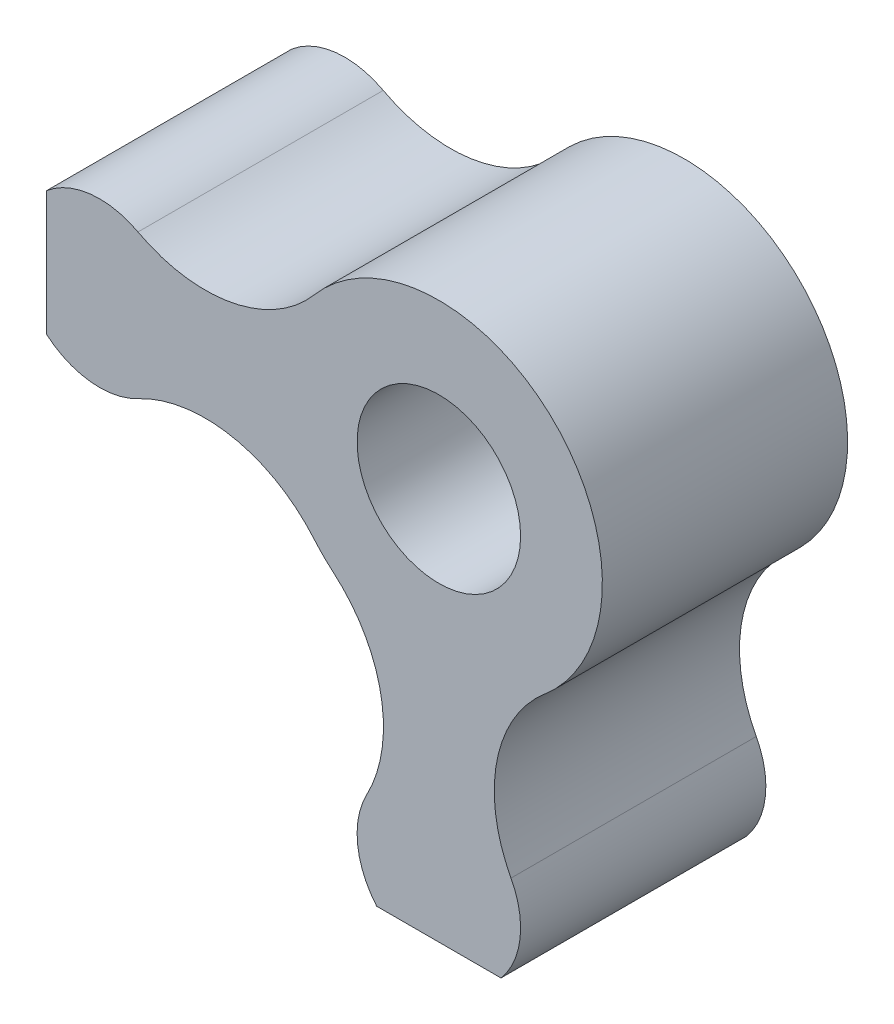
ISO-10303-21;
HEADER;
FILE_DESCRIPTION(('STEP AP214'),'2;1');
FILE_NAME('part.step','',(''),(''),'','','');
FILE_SCHEMA(('AUTOMOTIVE_DESIGN { 1 0 10303 214 1 1 1 1 }'));
ENDSEC;
DATA;
#1=APPLICATION_CONTEXT('core data for automotive mechanical design processes');
#2=APPLICATION_PROTOCOL_DEFINITION('international standard','automotive_design',2000,#1);
#3=PRODUCT_CONTEXT('',#1,'mechanical');
#4=PRODUCT('Part','Part','',(#3));
#5=PRODUCT_RELATED_PRODUCT_CATEGORY('part','',(#4));
#6=PRODUCT_DEFINITION_FORMATION('','',#4);
#7=PRODUCT_DEFINITION_CONTEXT('part definition',#1,'design');
#8=PRODUCT_DEFINITION('design','',#6,#7);
#9=PRODUCT_DEFINITION_SHAPE('','',#8);
#10=(LENGTH_UNIT() NAMED_UNIT(*) SI_UNIT(.MILLI.,.METRE.));
#11=(NAMED_UNIT(*) PLANE_ANGLE_UNIT() SI_UNIT($,.RADIAN.));
#12=(NAMED_UNIT(*) SI_UNIT($,.STERADIAN.) SOLID_ANGLE_UNIT());
#13=UNCERTAINTY_MEASURE_WITH_UNIT(LENGTH_MEASURE(1.E-05),#10,'distance_accuracy_value','');
#14=(GEOMETRIC_REPRESENTATION_CONTEXT(3) GLOBAL_UNCERTAINTY_ASSIGNED_CONTEXT((#13)) GLOBAL_UNIT_ASSIGNED_CONTEXT((#10,
#11,#12)) REPRESENTATION_CONTEXT('',''));
#15=CARTESIAN_POINT('',(0.,0.,0.));
#16=DIRECTION('',(0.,0.,1.));
#17=DIRECTION('',(1.,0.,0.));
#18=AXIS2_PLACEMENT_3D('',#15,#16,#17);
#19=CARTESIAN_POINT('',(0.,0.,3.));
#20=DIRECTION('',(0.,0.,1.));
#21=DIRECTION('',(1.,0.,0.));
#22=AXIS2_PLACEMENT_3D('',#19,#20,#21);
#23=PLANE('',#22);
#24=CARTESIAN_POINT('',(0.,0.,3.));
#25=DIRECTION('',(0.,0.,1.));
#26=DIRECTION('',(1.,0.,0.));
#27=AXIS2_PLACEMENT_3D('',#24,#25,#26);
#28=CIRCLE('',#27,4.);
#29=CARTESIAN_POINT('',(2.58951396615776,-3.04867469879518,3.));
#30=VERTEX_POINT('',#29);
#31=CARTESIAN_POINT('',(-3.04867469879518,2.58951396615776,3.));
#32=VERTEX_POINT('',#31);
#33=EDGE_CURVE('E482',#30,#32,#28,.T.);
#34=ORIENTED_EDGE('',*,*,#33,.T.);
#35=CARTESIAN_POINT('',(-5.71626506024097,4.85533868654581,3.));
#36=DIRECTION('',(0.,0.,-1.));
#37=DIRECTION('',(1.,0.,0.));
#38=AXIS2_PLACEMENT_3D('',#35,#36,#37);
#39=CIRCLE('',#38,3.5);
#40=CARTESIAN_POINT('',(-7.36046002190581,1.76557770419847,3.));
#41=VERTEX_POINT('',#40);
#42=EDGE_CURVE('E451',#32,#41,#39,.T.);
#43=ORIENTED_EDGE('',*,*,#42,.T.);
#44=CARTESIAN_POINT('',(-8.3,0.,3.));
#45=DIRECTION('',(0.,0.,1.));
#46=DIRECTION('',(1.,0.,0.));
#47=AXIS2_PLACEMENT_3D('',#44,#45,#46);
#48=CIRCLE('',#47,2.);
#49=CARTESIAN_POINT('',(-9.6,1.51986841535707,3.));
#50=VERTEX_POINT('',#49);
#51=EDGE_CURVE('E485',#41,#50,#48,.T.);
#52=ORIENTED_EDGE('',*,*,#51,.T.);
#53=DIRECTION('',(0.,-1.,0.));
#54=VECTOR('',#53,1.);
#55=CARTESIAN_POINT('',(-9.6,1.51986841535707,3.));
#56=LINE('',#55,#54);
#57=CARTESIAN_POINT('',(-9.6,-1.51986841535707,3.));
#58=VERTEX_POINT('',#57);
#59=EDGE_CURVE('E487',#50,#58,#56,.T.);
#60=ORIENTED_EDGE('',*,*,#59,.T.);
#61=CARTESIAN_POINT('',(-8.3,0.,3.));
#62=DIRECTION('',(0.,0.,1.));
#63=DIRECTION('',(1.,0.,0.));
#64=AXIS2_PLACEMENT_3D('',#61,#62,#63);
#65=CIRCLE('',#64,2.);
#66=CARTESIAN_POINT('',(-7.3604600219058,-1.76557770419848,3.));
#67=VERTEX_POINT('',#66);
#68=EDGE_CURVE('E489',#58,#67,#65,.T.);
#69=ORIENTED_EDGE('',*,*,#68,.T.);
#70=CARTESIAN_POINT('',(-5.71626506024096,-4.85533868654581,3.));
#71=DIRECTION('',(0.,0.,-1.));
#72=DIRECTION('',(1.,0.,0.));
#73=AXIS2_PLACEMENT_3D('',#70,#71,#72);
#74=CIRCLE('',#73,3.5);
#75=CARTESIAN_POINT('',(-3.04867469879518,-2.58951396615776,3.));
#76=VERTEX_POINT('',#75);
#77=EDGE_CURVE('E491',#67,#76,#74,.T.);
#78=ORIENTED_EDGE('',*,*,#77,.T.);
#79=CARTESIAN_POINT('',(0.,0.,3.));
#80=DIRECTION('',(0.,0.,1.));
#81=DIRECTION('',(1.,0.,0.));
#82=AXIS2_PLACEMENT_3D('',#79,#80,#81);
#83=CIRCLE('',#82,4.);
#84=CARTESIAN_POINT('',(-2.58951396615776,-3.04867469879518,3.));
#85=VERTEX_POINT('',#84);
#86=EDGE_CURVE('E493',#76,#85,#83,.T.);
#87=ORIENTED_EDGE('',*,*,#86,.T.);
#88=CARTESIAN_POINT('',(-4.85533868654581,-5.71626506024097,3.));
#89=DIRECTION('',(0.,0.,-1.));
#90=DIRECTION('',(1.,0.,0.));
#91=AXIS2_PLACEMENT_3D('',#88,#89,#90);
#92=CIRCLE('',#91,3.5);
#93=CARTESIAN_POINT('',(-1.76557770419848,-7.36046002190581,3.));
#94=VERTEX_POINT('',#93);
#95=EDGE_CURVE('E495',#85,#94,#92,.T.);
#96=ORIENTED_EDGE('',*,*,#95,.T.);
#97=CARTESIAN_POINT('',(0.,-8.3,3.));
#98=DIRECTION('',(0.,0.,1.));
#99=DIRECTION('',(1.,0.,0.));
#100=AXIS2_PLACEMENT_3D('',#97,#98,#99);
#101=CIRCLE('',#100,2.);
#102=CARTESIAN_POINT('',(-1.51986841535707,-9.6,3.));
#103=VERTEX_POINT('',#102);
#104=EDGE_CURVE('E497',#94,#103,#101,.T.);
#105=ORIENTED_EDGE('',*,*,#104,.T.);
#106=DIRECTION('',(1.,0.,0.));
#107=VECTOR('',#106,1.);
#108=CARTESIAN_POINT('',(-1.51986841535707,-9.6,3.));
#109=LINE('',#108,#107);
#110=CARTESIAN_POINT('',(1.51986841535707,-9.6,3.));
#111=VERTEX_POINT('',#110);
#112=EDGE_CURVE('E499',#103,#111,#109,.T.);
#113=ORIENTED_EDGE('',*,*,#112,.T.);
#114=CARTESIAN_POINT('',(0.,-8.3,3.));
#115=DIRECTION('',(0.,0.,1.));
#116=DIRECTION('',(1.,0.,0.));
#117=AXIS2_PLACEMENT_3D('',#114,#115,#116);
#118=CIRCLE('',#117,2.);
#119=CARTESIAN_POINT('',(1.76557770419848,-7.3604600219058,3.));
#120=VERTEX_POINT('',#119);
#121=EDGE_CURVE('E368',#111,#120,#118,.T.);
#122=ORIENTED_EDGE('',*,*,#121,.T.);
#123=CARTESIAN_POINT('',(4.85533868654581,-5.71626506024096,3.));
#124=DIRECTION('',(0.,0.,-1.));
#125=DIRECTION('',(1.,0.,0.));
#126=AXIS2_PLACEMENT_3D('',#123,#124,#125);
#127=CIRCLE('',#126,3.5);
#128=EDGE_CURVE('E363',#120,#30,#127,.T.);
#129=ORIENTED_EDGE('',*,*,#128,.T.);
#130=EDGE_LOOP('',(#34,#43,#52,#60,#69,#78,#87,#96,#105,#113,#122,#129));
#131=FACE_BOUND('',#130,.T.);
#132=CARTESIAN_POINT('',(0.,0.,3.));
#133=DIRECTION('',(0.,0.,1.));
#134=DIRECTION('',(1.,0.,0.));
#135=AXIS2_PLACEMENT_3D('',#132,#133,#134);
#136=CIRCLE('',#135,2.);
#137=CARTESIAN_POINT('',(2.,0.,3.));
#138=VERTEX_POINT('',#137);
#139=EDGE_CURVE('E456',#138,#138,#136,.T.);
#140=ORIENTED_EDGE('',*,*,#139,.F.);
#141=EDGE_LOOP('',(#140));
#142=FACE_BOUND('',#141,.T.);
#143=ADVANCED_FACE('F348',(#131,#142),#23,.T.);
#144=CARTESIAN_POINT('',(0.,0.,-3.));
#145=DIRECTION('',(0.,0.,1.));
#146=DIRECTION('',(1.,0.,0.));
#147=AXIS2_PLACEMENT_3D('',#144,#145,#146);
#148=PLANE('',#147);
#149=CARTESIAN_POINT('',(0.,0.,-3.));
#150=DIRECTION('',(0.,0.,1.));
#151=DIRECTION('',(1.,0.,0.));
#152=AXIS2_PLACEMENT_3D('',#149,#150,#151);
#153=CIRCLE('',#152,4.);
#154=CARTESIAN_POINT('',(2.58951396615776,-3.04867469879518,-3.));
#155=VERTEX_POINT('',#154);
#156=CARTESIAN_POINT('',(-3.04867469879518,2.58951396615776,-3.));
#157=VERTEX_POINT('',#156);
#158=EDGE_CURVE('E442',#155,#157,#153,.T.);
#159=ORIENTED_EDGE('',*,*,#158,.F.);
#160=CARTESIAN_POINT('',(4.85533868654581,-5.71626506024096,-3.));
#161=DIRECTION('',(0.,0.,-1.));
#162=DIRECTION('',(1.,0.,0.));
#163=AXIS2_PLACEMENT_3D('',#160,#161,#162);
#164=CIRCLE('',#163,3.5);
#165=CARTESIAN_POINT('',(1.76557770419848,-7.3604600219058,-3.));
#166=VERTEX_POINT('',#165);
#167=EDGE_CURVE('E480',#166,#155,#164,.T.);
#168=ORIENTED_EDGE('',*,*,#167,.F.);
#169=CARTESIAN_POINT('',(0.,-8.3,-3.));
#170=DIRECTION('',(0.,0.,1.));
#171=DIRECTION('',(1.,0.,0.));
#172=AXIS2_PLACEMENT_3D('',#169,#170,#171);
#173=CIRCLE('',#172,2.);
#174=CARTESIAN_POINT('',(1.51986841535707,-9.6,-3.));
#175=VERTEX_POINT('',#174);
#176=EDGE_CURVE('E478',#175,#166,#173,.T.);
#177=ORIENTED_EDGE('',*,*,#176,.F.);
#178=DIRECTION('',(1.,0.,0.));
#179=VECTOR('',#178,1.);
#180=CARTESIAN_POINT('',(-1.51986841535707,-9.6,-3.));
#181=LINE('',#180,#179);
#182=CARTESIAN_POINT('',(-1.51986841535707,-9.6,-3.));
#183=VERTEX_POINT('',#182);
#184=EDGE_CURVE('E476',#183,#175,#181,.T.);
#185=ORIENTED_EDGE('',*,*,#184,.F.);
#186=CARTESIAN_POINT('',(0.,-8.3,-3.));
#187=DIRECTION('',(0.,0.,1.));
#188=DIRECTION('',(1.,0.,0.));
#189=AXIS2_PLACEMENT_3D('',#186,#187,#188);
#190=CIRCLE('',#189,2.);
#191=CARTESIAN_POINT('',(-1.76557770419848,-7.36046002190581,-3.));
#192=VERTEX_POINT('',#191);
#193=EDGE_CURVE('E474',#192,#183,#190,.T.);
#194=ORIENTED_EDGE('',*,*,#193,.F.);
#195=CARTESIAN_POINT('',(-4.85533868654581,-5.71626506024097,-3.));
#196=DIRECTION('',(0.,0.,-1.));
#197=DIRECTION('',(1.,0.,0.));
#198=AXIS2_PLACEMENT_3D('',#195,#196,#197);
#199=CIRCLE('',#198,3.5);
#200=CARTESIAN_POINT('',(-2.58951396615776,-3.04867469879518,-3.));
#201=VERTEX_POINT('',#200);
#202=EDGE_CURVE('E472',#201,#192,#199,.T.);
#203=ORIENTED_EDGE('',*,*,#202,.F.);
#204=CARTESIAN_POINT('',(0.,0.,-3.));
#205=DIRECTION('',(0.,0.,1.));
#206=DIRECTION('',(1.,0.,0.));
#207=AXIS2_PLACEMENT_3D('',#204,#205,#206);
#208=CIRCLE('',#207,4.);
#209=CARTESIAN_POINT('',(-3.04867469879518,-2.58951396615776,-3.));
#210=VERTEX_POINT('',#209);
#211=EDGE_CURVE('E470',#210,#201,#208,.T.);
#212=ORIENTED_EDGE('',*,*,#211,.F.);
#213=CARTESIAN_POINT('',(-5.71626506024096,-4.85533868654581,-3.));
#214=DIRECTION('',(0.,0.,-1.));
#215=DIRECTION('',(1.,0.,0.));
#216=AXIS2_PLACEMENT_3D('',#213,#214,#215);
#217=CIRCLE('',#216,3.5);
#218=CARTESIAN_POINT('',(-7.3604600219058,-1.76557770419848,-3.));
#219=VERTEX_POINT('',#218);
#220=EDGE_CURVE('E468',#219,#210,#217,.T.);
#221=ORIENTED_EDGE('',*,*,#220,.F.);
#222=CARTESIAN_POINT('',(-8.3,0.,-3.));
#223=DIRECTION('',(0.,0.,1.));
#224=DIRECTION('',(1.,0.,0.));
#225=AXIS2_PLACEMENT_3D('',#222,#223,#224);
#226=CIRCLE('',#225,2.);
#227=CARTESIAN_POINT('',(-9.6,-1.51986841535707,-3.));
#228=VERTEX_POINT('',#227);
#229=EDGE_CURVE('E466',#228,#219,#226,.T.);
#230=ORIENTED_EDGE('',*,*,#229,.F.);
#231=DIRECTION('',(0.,-1.,0.));
#232=VECTOR('',#231,1.);
#233=CARTESIAN_POINT('',(-9.6,1.51986841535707,-3.));
#234=LINE('',#233,#232);
#235=CARTESIAN_POINT('',(-9.6,1.51986841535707,-3.));
#236=VERTEX_POINT('',#235);
#237=EDGE_CURVE('E464',#236,#228,#234,.T.);
#238=ORIENTED_EDGE('',*,*,#237,.F.);
#239=CARTESIAN_POINT('',(-8.3,0.,-3.));
#240=DIRECTION('',(0.,0.,1.));
#241=DIRECTION('',(1.,0.,0.));
#242=AXIS2_PLACEMENT_3D('',#239,#240,#241);
#243=CIRCLE('',#242,2.);
#244=CARTESIAN_POINT('',(-7.36046002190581,1.76557770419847,-3.));
#245=VERTEX_POINT('',#244);
#246=EDGE_CURVE('E444',#245,#236,#243,.T.);
#247=ORIENTED_EDGE('',*,*,#246,.F.);
#248=CARTESIAN_POINT('',(-5.71626506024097,4.85533868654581,-3.));
#249=DIRECTION('',(0.,0.,-1.));
#250=DIRECTION('',(1.,0.,0.));
#251=AXIS2_PLACEMENT_3D('',#248,#249,#250);
#252=CIRCLE('',#251,3.5);
#253=EDGE_CURVE('E437',#157,#245,#252,.T.);
#254=ORIENTED_EDGE('',*,*,#253,.F.);
#255=EDGE_LOOP('',(#159,#168,#177,#185,#194,#203,#212,#221,#230,#238,#247,#254));
#256=FACE_BOUND('',#255,.T.);
#257=CARTESIAN_POINT('',(0.,0.,-3.));
#258=DIRECTION('',(0.,0.,1.));
#259=DIRECTION('',(1.,0.,0.));
#260=AXIS2_PLACEMENT_3D('',#257,#258,#259);
#261=CIRCLE('',#260,2.);
#262=CARTESIAN_POINT('',(2.,0.,-3.));
#263=VERTEX_POINT('',#262);
#264=EDGE_CURVE('E459',#263,#263,#261,.T.);
#265=ORIENTED_EDGE('',*,*,#264,.T.);
#266=EDGE_LOOP('',(#265));
#267=FACE_BOUND('',#266,.T.);
#268=ADVANCED_FACE('F438',(#256,#267),#148,.F.);
#269=CARTESIAN_POINT('',(0.,0.,3.));
#270=DIRECTION('',(0.,0.,-1.));
#271=DIRECTION('',(-1.,0.,0.));
#272=AXIS2_PLACEMENT_3D('',#269,#270,#271);
#273=CYLINDRICAL_SURFACE('',#272,4.);
#274=ORIENTED_EDGE('',*,*,#158,.T.);
#275=DIRECTION('',(0.,0.,-1.));
#276=VECTOR('',#275,1.);
#277=CARTESIAN_POINT('',(-3.04867469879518,2.58951396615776,3.));
#278=LINE('',#277,#276);
#279=EDGE_CURVE('E11',#32,#157,#278,.T.);
#280=ORIENTED_EDGE('',*,*,#279,.F.);
#281=ORIENTED_EDGE('',*,*,#33,.F.);
#282=DIRECTION('',(0.,0.,-1.));
#283=VECTOR('',#282,1.);
#284=CARTESIAN_POINT('',(2.58951396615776,-3.04867469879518,3.));
#285=LINE('',#284,#283);
#286=EDGE_CURVE('E455',#30,#155,#285,.T.);
#287=ORIENTED_EDGE('',*,*,#286,.T.);
#288=EDGE_LOOP('',(#274,#280,#281,#287));
#289=FACE_BOUND('',#288,.T.);
#290=ADVANCED_FACE('F350',(#289),#273,.T.);
#291=CARTESIAN_POINT('',(-5.71626506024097,4.85533868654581,3.));
#292=DIRECTION('',(0.,0.,-1.));
#293=DIRECTION('',(-1.,0.,0.));
#294=AXIS2_PLACEMENT_3D('',#291,#292,#293);
#295=CYLINDRICAL_SURFACE('',#294,3.5);
#296=ORIENTED_EDGE('',*,*,#253,.T.);
#297=DIRECTION('',(0.,0.,-1.));
#298=VECTOR('',#297,1.);
#299=CARTESIAN_POINT('',(-7.36046002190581,1.76557770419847,3.));
#300=LINE('',#299,#298);
#301=EDGE_CURVE('E356',#41,#245,#300,.T.);
#302=ORIENTED_EDGE('',*,*,#301,.F.);
#303=ORIENTED_EDGE('',*,*,#42,.F.);
#304=ORIENTED_EDGE('',*,*,#279,.T.);
#305=EDGE_LOOP('',(#296,#302,#303,#304));
#306=FACE_BOUND('',#305,.T.);
#307=ADVANCED_FACE('F450',(#306),#295,.F.);
#308=CARTESIAN_POINT('',(-8.3,0.,3.));
#309=DIRECTION('',(0.,0.,-1.));
#310=DIRECTION('',(-1.,0.,0.));
#311=AXIS2_PLACEMENT_3D('',#308,#309,#310);
#312=CYLINDRICAL_SURFACE('',#311,2.);
#313=ORIENTED_EDGE('',*,*,#246,.T.);
#314=DIRECTION('',(0.,0.,-1.));
#315=VECTOR('',#314,1.);
#316=CARTESIAN_POINT('',(-9.6,1.51986841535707,3.));
#317=LINE('',#316,#315);
#318=EDGE_CURVE('E528',#50,#236,#317,.T.);
#319=ORIENTED_EDGE('',*,*,#318,.F.);
#320=ORIENTED_EDGE('',*,*,#51,.F.);
#321=ORIENTED_EDGE('',*,*,#301,.T.);
#322=EDGE_LOOP('',(#313,#319,#320,#321));
#323=FACE_BOUND('',#322,.T.);
#324=ADVANCED_FACE('F532',(#323),#312,.T.);
#325=CARTESIAN_POINT('',(-9.6,1.51986841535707,3.));
#326=DIRECTION('',(1.,0.,0.));
#327=DIRECTION('',(0.,0.,-1.));
#328=AXIS2_PLACEMENT_3D('',#325,#326,#327);
#329=PLANE('',#328);
#330=ORIENTED_EDGE('',*,*,#237,.T.);
#331=DIRECTION('',(0.,0.,-1.));
#332=VECTOR('',#331,1.);
#333=CARTESIAN_POINT('',(-9.6,-1.51986841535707,3.));
#334=LINE('',#333,#332);
#335=EDGE_CURVE('E525',#58,#228,#334,.T.);
#336=ORIENTED_EDGE('',*,*,#335,.F.);
#337=ORIENTED_EDGE('',*,*,#59,.F.);
#338=ORIENTED_EDGE('',*,*,#318,.T.);
#339=EDGE_LOOP('',(#330,#336,#337,#338));
#340=FACE_BOUND('',#339,.T.);
#341=ADVANCED_FACE('F540',(#340),#329,.F.);
#342=CARTESIAN_POINT('',(-8.3,0.,3.));
#343=DIRECTION('',(0.,0.,-1.));
#344=DIRECTION('',(-1.,0.,0.));
#345=AXIS2_PLACEMENT_3D('',#342,#343,#344);
#346=CYLINDRICAL_SURFACE('',#345,2.);
#347=ORIENTED_EDGE('',*,*,#229,.T.);
#348=DIRECTION('',(0.,0.,-1.));
#349=VECTOR('',#348,1.);
#350=CARTESIAN_POINT('',(-7.3604600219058,-1.76557770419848,3.));
#351=LINE('',#350,#349);
#352=EDGE_CURVE('E522',#67,#219,#351,.T.);
#353=ORIENTED_EDGE('',*,*,#352,.F.);
#354=ORIENTED_EDGE('',*,*,#68,.F.);
#355=ORIENTED_EDGE('',*,*,#335,.T.);
#356=EDGE_LOOP('',(#347,#353,#354,#355));
#357=FACE_BOUND('',#356,.T.);
#358=ADVANCED_FACE('F543',(#357),#346,.T.);
#359=CARTESIAN_POINT('',(-5.71626506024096,-4.85533868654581,3.));
#360=DIRECTION('',(0.,0.,-1.));
#361=DIRECTION('',(-1.,0.,0.));
#362=AXIS2_PLACEMENT_3D('',#359,#360,#361);
#363=CYLINDRICAL_SURFACE('',#362,3.5);
#364=ORIENTED_EDGE('',*,*,#220,.T.);
#365=DIRECTION('',(0.,0.,-1.));
#366=VECTOR('',#365,1.);
#367=CARTESIAN_POINT('',(-3.04867469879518,-2.58951396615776,3.));
#368=LINE('',#367,#366);
#369=EDGE_CURVE('E519',#76,#210,#368,.T.);
#370=ORIENTED_EDGE('',*,*,#369,.F.);
#371=ORIENTED_EDGE('',*,*,#77,.F.);
#372=ORIENTED_EDGE('',*,*,#352,.T.);
#373=EDGE_LOOP('',(#364,#370,#371,#372));
#374=FACE_BOUND('',#373,.T.);
#375=ADVANCED_FACE('F548',(#374),#363,.F.);
#376=CARTESIAN_POINT('',(0.,0.,3.));
#377=DIRECTION('',(0.,0.,-1.));
#378=DIRECTION('',(-1.,0.,0.));
#379=AXIS2_PLACEMENT_3D('',#376,#377,#378);
#380=CYLINDRICAL_SURFACE('',#379,4.);
#381=ORIENTED_EDGE('',*,*,#211,.T.);
#382=DIRECTION('',(0.,0.,-1.));
#383=VECTOR('',#382,1.);
#384=CARTESIAN_POINT('',(-2.58951396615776,-3.04867469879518,3.));
#385=LINE('',#384,#383);
#386=EDGE_CURVE('E516',#85,#201,#385,.T.);
#387=ORIENTED_EDGE('',*,*,#386,.F.);
#388=ORIENTED_EDGE('',*,*,#86,.F.);
#389=ORIENTED_EDGE('',*,*,#369,.T.);
#390=EDGE_LOOP('',(#381,#387,#388,#389));
#391=FACE_BOUND('',#390,.T.);
#392=ADVANCED_FACE('F554',(#391),#380,.T.);
#393=CARTESIAN_POINT('',(-4.85533868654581,-5.71626506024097,3.));
#394=DIRECTION('',(0.,0.,-1.));
#395=DIRECTION('',(-1.,0.,0.));
#396=AXIS2_PLACEMENT_3D('',#393,#394,#395);
#397=CYLINDRICAL_SURFACE('',#396,3.5);
#398=ORIENTED_EDGE('',*,*,#202,.T.);
#399=DIRECTION('',(0.,0.,-1.));
#400=VECTOR('',#399,1.);
#401=CARTESIAN_POINT('',(-1.76557770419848,-7.36046002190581,3.));
#402=LINE('',#401,#400);
#403=EDGE_CURVE('E513',#94,#192,#402,.T.);
#404=ORIENTED_EDGE('',*,*,#403,.F.);
#405=ORIENTED_EDGE('',*,*,#95,.F.);
#406=ORIENTED_EDGE('',*,*,#386,.T.);
#407=EDGE_LOOP('',(#398,#404,#405,#406));
#408=FACE_BOUND('',#407,.T.);
#409=ADVANCED_FACE('F558',(#408),#397,.F.);
#410=CARTESIAN_POINT('',(0.,-8.3,3.));
#411=DIRECTION('',(0.,0.,-1.));
#412=DIRECTION('',(-1.,0.,0.));
#413=AXIS2_PLACEMENT_3D('',#410,#411,#412);
#414=CYLINDRICAL_SURFACE('',#413,2.);
#415=ORIENTED_EDGE('',*,*,#193,.T.);
#416=DIRECTION('',(0.,0.,-1.));
#417=VECTOR('',#416,1.);
#418=CARTESIAN_POINT('',(-1.51986841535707,-9.6,3.));
#419=LINE('',#418,#417);
#420=EDGE_CURVE('E510',#103,#183,#419,.T.);
#421=ORIENTED_EDGE('',*,*,#420,.F.);
#422=ORIENTED_EDGE('',*,*,#104,.F.);
#423=ORIENTED_EDGE('',*,*,#403,.T.);
#424=EDGE_LOOP('',(#415,#421,#422,#423));
#425=FACE_BOUND('',#424,.T.);
#426=ADVANCED_FACE('F563',(#425),#414,.T.);
#427=CARTESIAN_POINT('',(-1.51986841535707,-9.6,3.));
#428=DIRECTION('',(0.,1.,0.));
#429=DIRECTION('',(0.,0.,1.));
#430=AXIS2_PLACEMENT_3D('',#427,#428,#429);
#431=PLANE('',#430);
#432=ORIENTED_EDGE('',*,*,#184,.T.);
#433=DIRECTION('',(0.,0.,-1.));
#434=VECTOR('',#433,1.);
#435=CARTESIAN_POINT('',(1.51986841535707,-9.6,3.));
#436=LINE('',#435,#434);
#437=EDGE_CURVE('E507',#111,#175,#436,.T.);
#438=ORIENTED_EDGE('',*,*,#437,.F.);
#439=ORIENTED_EDGE('',*,*,#112,.F.);
#440=ORIENTED_EDGE('',*,*,#420,.T.);
#441=EDGE_LOOP('',(#432,#438,#439,#440));
#442=FACE_BOUND('',#441,.T.);
#443=ADVANCED_FACE('F567',(#442),#431,.F.);
#444=CARTESIAN_POINT('',(0.,-8.3,3.));
#445=DIRECTION('',(0.,0.,-1.));
#446=DIRECTION('',(-1.,0.,0.));
#447=AXIS2_PLACEMENT_3D('',#444,#445,#446);
#448=CYLINDRICAL_SURFACE('',#447,2.);
#449=ORIENTED_EDGE('',*,*,#176,.T.);
#450=DIRECTION('',(0.,0.,-1.));
#451=VECTOR('',#450,1.);
#452=CARTESIAN_POINT('',(1.76557770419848,-7.3604600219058,3.));
#453=LINE('',#452,#451);
#454=EDGE_CURVE('E504',#120,#166,#453,.T.);
#455=ORIENTED_EDGE('',*,*,#454,.F.);
#456=ORIENTED_EDGE('',*,*,#121,.F.);
#457=ORIENTED_EDGE('',*,*,#437,.T.);
#458=EDGE_LOOP('',(#449,#455,#456,#457));
#459=FACE_BOUND('',#458,.T.);
#460=ADVANCED_FACE('F571',(#459),#448,.T.);
#461=CARTESIAN_POINT('',(4.85533868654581,-5.71626506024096,3.));
#462=DIRECTION('',(0.,0.,-1.));
#463=DIRECTION('',(-1.,0.,0.));
#464=AXIS2_PLACEMENT_3D('',#461,#462,#463);
#465=CYLINDRICAL_SURFACE('',#464,3.5);
#466=ORIENTED_EDGE('',*,*,#167,.T.);
#467=ORIENTED_EDGE('',*,*,#286,.F.);
#468=ORIENTED_EDGE('',*,*,#128,.F.);
#469=ORIENTED_EDGE('',*,*,#454,.T.);
#470=EDGE_LOOP('',(#466,#467,#468,#469));
#471=FACE_BOUND('',#470,.T.);
#472=ADVANCED_FACE('F573',(#471),#465,.F.);
#473=CARTESIAN_POINT('',(0.,0.,3.));
#474=DIRECTION('',(0.,0.,-1.));
#475=DIRECTION('',(-1.,0.,0.));
#476=AXIS2_PLACEMENT_3D('',#473,#474,#475);
#477=CYLINDRICAL_SURFACE('',#476,2.);
#478=ORIENTED_EDGE('',*,*,#139,.T.);
#479=EDGE_LOOP('',(#478));
#480=FACE_BOUND('',#479,.T.);
#481=ORIENTED_EDGE('',*,*,#264,.F.);
#482=EDGE_LOOP('',(#481));
#483=FACE_BOUND('',#482,.T.);
#484=ADVANCED_FACE('F575',(#480,#483),#477,.F.);
#485=CLOSED_SHELL('',(#143,#268,#290,#307,#324,#341,#358,#375,#392,#409,#426,#443,#460,#472,#484));
#486=MANIFOLD_SOLID_BREP('B2',#485);
#487=ADVANCED_BREP_SHAPE_REPRESENTATION('',(#18,#486),#14);
#488=SHAPE_DEFINITION_REPRESENTATION(#9,#487);
ENDSEC;
END-ISO-10303-21;
